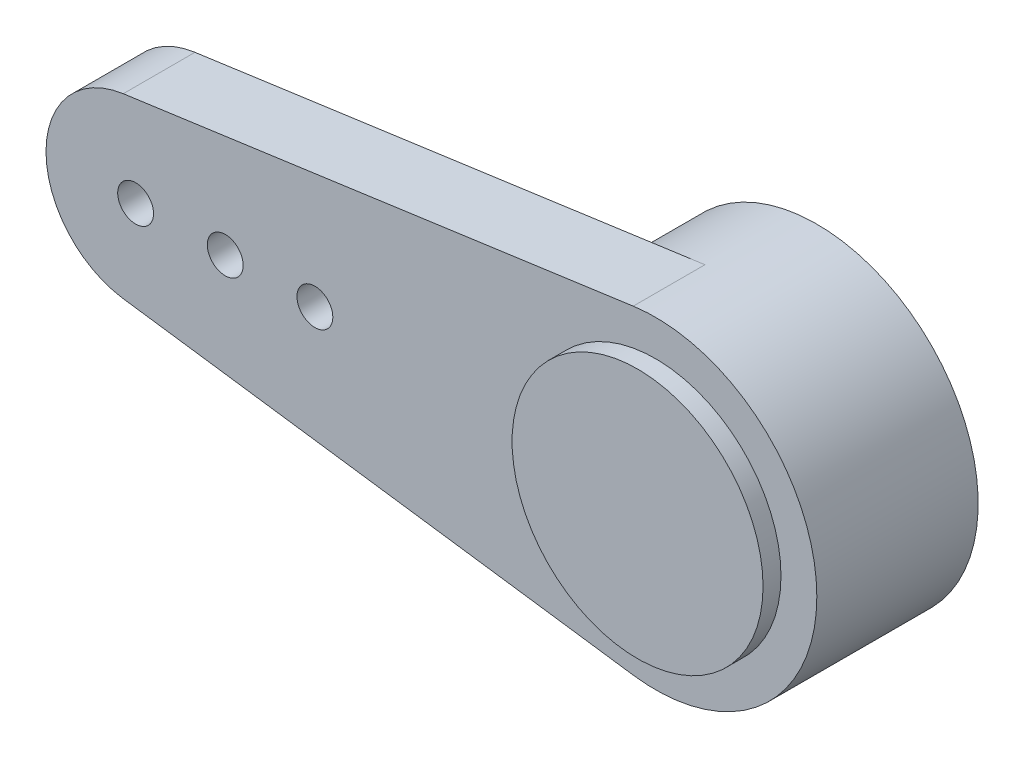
from build123d import *

# Parameters (mm, degrees)
ESQUISSE1_R      = 0.5
EXTRUSION6_DEPTH = 2
ESQUISSE2_R      = 3.5
EXTRUSION7_DEPTH = 0.5
EXTRUSION8_START = 2.5
ESQUISSE3_R      = 4.5
EXTRUSION8_DEPTH = 2.5
ESQUISSE4_R      = 2.9
EXTRUSION9_DEPTH = 2.7


with BuildPart() as part:
    # Esquisse1 → Extrusion6 (new body)
    with BuildSketch(Plane.XY):
        with BuildLine():
            Line((-14.844827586, 2.476104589), (-0.620689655, 4.45698826))
            ThreePointArc((-0.620689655, 4.45698826), (4.5, 0), (-0.620689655, -4.45698826))
            Line((-0.620689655, -4.45698826), (-14.844827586, -2.476104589))
            ThreePointArc((-14.844827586, -2.476104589), (-17, 0), (-14.844827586, 2.476104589))
        make_face()
        with Locations((-14.5, 0)):
            Circle(ESQUISSE1_R, mode=Mode.SUBTRACT)
        with Locations((-12, 0)):
            Circle(ESQUISSE1_R, mode=Mode.SUBTRACT)
        with Locations((-9.5, 0)):
            Circle(ESQUISSE1_R, mode=Mode.SUBTRACT)
    extrude(amount=EXTRUSION6_DEPTH)

    # Esquisse2 → Extrusion7 (add)
    with BuildSketch(Plane.XY.offset(2)):
        Circle(ESQUISSE2_R)
    extrude(amount=EXTRUSION7_DEPTH)

    # Esquisse3 → Extrusion8 (add)
    with BuildSketch(Plane(origin=(0, 0, 0), x_dir=(-1, 0, 0), z_dir=(0, 0, -1)).offset(EXTRUSION8_START)):
        Circle(ESQUISSE3_R)
    extrude(amount=-EXTRUSION8_DEPTH)

    # Esquisse4 → Extrusion9 (cut)
    with BuildSketch(Plane(origin=(0, 0, -2.5), x_dir=(-1, 0, 0), z_dir=(0, 0, -1))):
        Circle(ESQUISSE4_R)
    extrude(amount=-EXTRUSION9_DEPTH, mode=Mode.SUBTRACT)


solid = part.part
